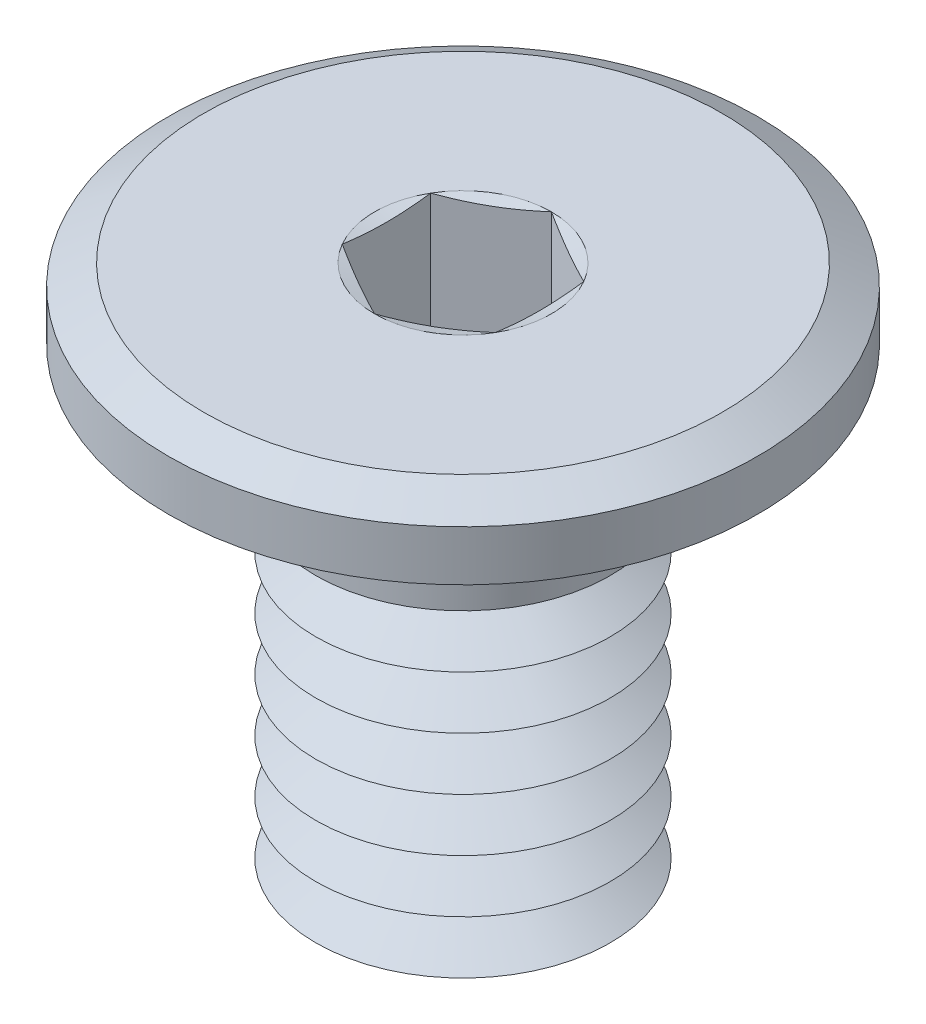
from build123d import *

# Parameters (mm, degrees)
SKETCH1_R           = 2.5
BOSS_EXTRUDE1_DEPTH = 0.6
SKETCH2_R           = 1.25
BOSS_EXTRUDE2_DEPTH = 4
LPATTERN1_COUNT     = 7
LPATTERN1_PITCH     = 0.45
FILLET1_R           = 0.1
CHAMFER2_SIZE       = 0.3
CHAMFER2_SIZE2      = 0.173205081
CUT_EXTRUDE1_DEPTH  = 1.2


with BuildPart() as part:
    # Sketch1 → Boss-Extrude1 (new body)
    with BuildSketch(Plane(origin=(0, 0, 0), x_dir=(1, 0, 0), z_dir=(0, 1, 0))):
        with Locations(Location((0, 0, 0), (0, 0, 270))):
            Circle(SKETCH1_R)
    extrude(amount=-BOSS_EXTRUDE1_DEPTH)

    # Sketch2 → Boss-Extrude2 (add)
    with BuildSketch(Plane.XZ.offset(0.6)):
        with Locations(Location((0, 0, 0), (0, 0, 270))):
            Circle(SKETCH2_R)
    extrude(amount=BOSS_EXTRUDE2_DEPTH)

    # Sketch5 → Cut-Revolve1 (revolve, cut)
    with BuildSketch(Plane(origin=(0, 0, 0), x_dir=(0, 0, -1), z_dir=(1, 0, 0))):
        Polygon((-1.25, -4.825), (-0.860288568, -4.6), (-1.25, -4.375), align=None)
    cut_revolve1 = revolve(axis=Axis((0, 0.990593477, 0), (0, -1, 0)), mode=Mode.SUBTRACT)

    # LPattern1: Cut-Revolve1 ×7
    with Locations(*[(0, i * LPATTERN1_PITCH, 0) for i in range(1, LPATTERN1_COUNT)]):
        add(cut_revolve1, mode=Mode.SUBTRACT)

    # Fillet1
    fillet1_edges = [part.edges().sort_by_distance(p)[0] for p in [
        (0, -0.6, 1.25),
    ]]
    fillet(fillet1_edges, radius=FILLET1_R)

    # Chamfer2
    chamfer2_edges = [part.edges().sort_by_distance(p)[0] for p in [
        (0, 0, -2.5),
    ]]
    chamfer2_side = [part.faces().sort_by_distance(p)[0] for p in [
        (0, 0, 0),
    ]]
    chamfer(chamfer2_edges, length=CHAMFER2_SIZE, length2=CHAMFER2_SIZE2, reference=chamfer2_side[0])

    # Sketch6 → Cut-Extrude1 (cut)
    with BuildSketch(Plane(origin=(0, 0, 0), x_dir=(1, 0, 0), z_dir=(0, 1, 0))):
        Polygon((0, 0.75055535), (-0.65, 0.375277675), (-0.65, -0.375277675), (0, -0.75055535), (0.65, -0.375277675), (0.65, 0.375277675), align=None)
    extrude(amount=-CUT_EXTRUDE1_DEPTH, mode=Mode.SUBTRACT)

    # Cut-Extrude2 cone 1 section (on through the dimple's axis) → Cut-Extrude2 (revolve, cut)
    with BuildSketch(Plane(origin=(0, -1.2, 0), x_dir=(0, 0, 1), z_dir=(1, 0, 0))):
        Polygon((0, 0), (0.65, 0), (0, 0.375277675), align=None)
    revolve(axis=Axis((0, -1.2, 0), (0, -1, 0)), mode=Mode.SUBTRACT)

    # Cut-Extrude3 cone 1 section (on through the dimple's axis) → Cut-Extrude3 (revolve, cut)
    with BuildSketch(Plane(origin=(0, 0, 0), x_dir=(0, 0, 1), z_dir=(1, 0, 0))):
        Polygon((0, 0), (0.75055535, 0), (0, 0.2011107), align=None)
    revolve(axis=Axis((0, 0, 0), (0, -1, 0)), mode=Mode.SUBTRACT)


solid = part.part
